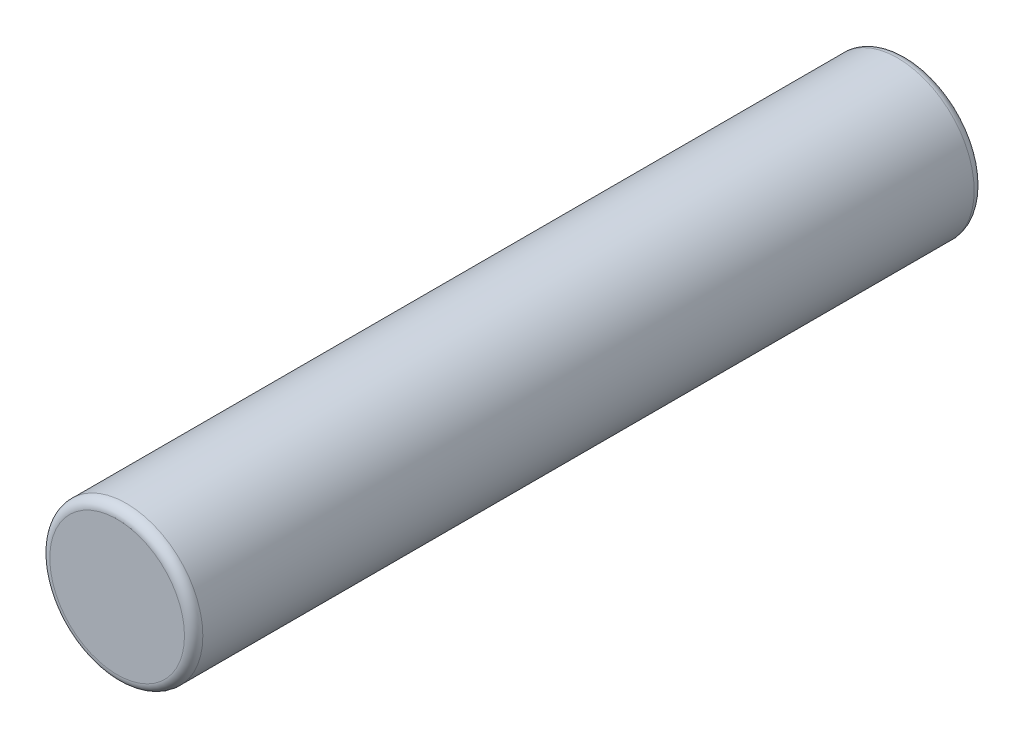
ISO-10303-21;
HEADER;
FILE_DESCRIPTION(('STEP AP214'),'2;1');
FILE_NAME('part.step','',(''),(''),'','','');
FILE_SCHEMA(('AUTOMOTIVE_DESIGN { 1 0 10303 214 1 1 1 1 }'));
ENDSEC;
DATA;
#1=APPLICATION_CONTEXT('core data for automotive mechanical design processes');
#2=APPLICATION_PROTOCOL_DEFINITION('international standard','automotive_design',2000,#1);
#3=PRODUCT_CONTEXT('',#1,'mechanical');
#4=PRODUCT('Part','Part','',(#3));
#5=PRODUCT_RELATED_PRODUCT_CATEGORY('part','',(#4));
#6=PRODUCT_DEFINITION_FORMATION('','',#4);
#7=PRODUCT_DEFINITION_CONTEXT('part definition',#1,'design');
#8=PRODUCT_DEFINITION('design','',#6,#7);
#9=PRODUCT_DEFINITION_SHAPE('','',#8);
#10=(LENGTH_UNIT() NAMED_UNIT(*) SI_UNIT(.MILLI.,.METRE.));
#11=(NAMED_UNIT(*) PLANE_ANGLE_UNIT() SI_UNIT($,.RADIAN.));
#12=(NAMED_UNIT(*) SI_UNIT($,.STERADIAN.) SOLID_ANGLE_UNIT());
#13=UNCERTAINTY_MEASURE_WITH_UNIT(LENGTH_MEASURE(1.E-05),#10,'distance_accuracy_value','');
#14=(GEOMETRIC_REPRESENTATION_CONTEXT(3) GLOBAL_UNCERTAINTY_ASSIGNED_CONTEXT((#13)) GLOBAL_UNIT_ASSIGNED_CONTEXT((#10,
#11,#12)) REPRESENTATION_CONTEXT('',''));
#15=CARTESIAN_POINT('',(0.,0.,0.));
#16=DIRECTION('',(0.,0.,1.));
#17=DIRECTION('',(1.,0.,0.));
#18=AXIS2_PLACEMENT_3D('',#15,#16,#17);
#19=CARTESIAN_POINT('',(0.,0.,25.7999999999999));
#20=DIRECTION('',(0.,0.,-1.));
#21=DIRECTION('',(-1.,0.,0.));
#22=AXIS2_PLACEMENT_3D('',#19,#20,#21);
#23=CYLINDRICAL_SURFACE('',#22,2.5);
#24=CARTESIAN_POINT('',(0.,0.,0.299999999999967));
#25=DIRECTION('',(0.,0.,1.));
#26=DIRECTION('',(1.,0.,0.));
#27=AXIS2_PLACEMENT_3D('',#24,#25,#26);
#28=CIRCLE('',#27,2.5);
#29=CARTESIAN_POINT('',(-2.49999999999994,0.,0.299999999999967));
#30=VERTEX_POINT('',#29);
#31=EDGE_CURVE('E40',#30,#30,#28,.T.);
#32=CARTESIAN_POINT('',(1.11022302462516E-13,0.,25.5));
#33=DIRECTION('',(0.,0.,1.));
#34=DIRECTION('',(1.,0.,0.));
#35=AXIS2_PLACEMENT_3D('',#32,#33,#34);
#36=CIRCLE('',#35,2.5);
#37=CARTESIAN_POINT('',(-2.49999999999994,0.,25.5));
#38=VERTEX_POINT('',#37);
#39=EDGE_CURVE('E44',#38,#38,#36,.F.);
#40=CARTESIAN_POINT('',(-2.49999999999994,0.,0.299999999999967));
#41=CARTESIAN_POINT('',(-2.49999999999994,0.,0.562499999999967));
#42=CARTESIAN_POINT('',(-2.49999999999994,0.,0.824999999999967));
#43=CARTESIAN_POINT('',(-2.49999999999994,0.,1.34999999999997));
#44=CARTESIAN_POINT('',(-2.49999999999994,0.,1.61249999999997));
#45=CARTESIAN_POINT('',(-2.49999999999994,0.,2.13749999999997));
#46=CARTESIAN_POINT('',(-2.49999999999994,0.,2.39999999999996));
#47=CARTESIAN_POINT('',(-2.49999999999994,0.,2.92499999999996));
#48=CARTESIAN_POINT('',(-2.49999999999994,0.,3.18749999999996));
#49=CARTESIAN_POINT('',(-2.49999999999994,0.,3.71249999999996));
#50=CARTESIAN_POINT('',(-2.49999999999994,0.,3.97499999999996));
#51=CARTESIAN_POINT('',(-2.49999999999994,0.,4.49999999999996));
#52=CARTESIAN_POINT('',(-2.49999999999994,0.,4.76249999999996));
#53=CARTESIAN_POINT('',(-2.49999999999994,0.,5.28749999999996));
#54=CARTESIAN_POINT('',(-2.49999999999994,0.,5.54999999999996));
#55=CARTESIAN_POINT('',(-2.49999999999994,0.,6.07499999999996));
#56=CARTESIAN_POINT('',(-2.49999999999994,0.,6.33749999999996));
#57=CARTESIAN_POINT('',(-2.49999999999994,0.,6.86249999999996));
#58=CARTESIAN_POINT('',(-2.49999999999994,0.,7.12499999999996));
#59=CARTESIAN_POINT('',(-2.49999999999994,0.,7.64999999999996));
#60=CARTESIAN_POINT('',(-2.49999999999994,0.,7.91249999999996));
#61=CARTESIAN_POINT('',(-2.49999999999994,0.,8.43749999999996));
#62=CARTESIAN_POINT('',(-2.49999999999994,0.,8.69999999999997));
#63=CARTESIAN_POINT('',(-2.49999999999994,0.,9.22499999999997));
#64=CARTESIAN_POINT('',(-2.49999999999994,0.,9.48749999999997));
#65=CARTESIAN_POINT('',(-2.49999999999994,0.,10.0125));
#66=CARTESIAN_POINT('',(-2.49999999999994,0.,10.275));
#67=CARTESIAN_POINT('',(-2.49999999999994,0.,10.8));
#68=CARTESIAN_POINT('',(-2.49999999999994,0.,11.0625));
#69=CARTESIAN_POINT('',(-2.49999999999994,0.,11.5875));
#70=CARTESIAN_POINT('',(-2.49999999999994,0.,11.85));
#71=CARTESIAN_POINT('',(-2.49999999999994,0.,12.375));
#72=CARTESIAN_POINT('',(-2.49999999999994,0.,12.6375));
#73=CARTESIAN_POINT('',(-2.49999999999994,0.,13.1625));
#74=CARTESIAN_POINT('',(-2.49999999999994,0.,13.425));
#75=CARTESIAN_POINT('',(-2.49999999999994,0.,13.95));
#76=CARTESIAN_POINT('',(-2.49999999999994,0.,14.2125));
#77=CARTESIAN_POINT('',(-2.49999999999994,0.,14.7375));
#78=CARTESIAN_POINT('',(-2.49999999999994,0.,15.));
#79=CARTESIAN_POINT('',(-2.49999999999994,0.,15.525));
#80=CARTESIAN_POINT('',(-2.49999999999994,0.,15.7875));
#81=CARTESIAN_POINT('',(-2.49999999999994,0.,16.3125));
#82=CARTESIAN_POINT('',(-2.49999999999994,0.,16.575));
#83=CARTESIAN_POINT('',(-2.49999999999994,0.,17.1));
#84=CARTESIAN_POINT('',(-2.49999999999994,0.,17.3625));
#85=CARTESIAN_POINT('',(-2.49999999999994,0.,17.8875));
#86=CARTESIAN_POINT('',(-2.49999999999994,0.,18.15));
#87=CARTESIAN_POINT('',(-2.49999999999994,0.,18.675));
#88=CARTESIAN_POINT('',(-2.49999999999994,0.,18.9375));
#89=CARTESIAN_POINT('',(-2.49999999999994,0.,19.4625));
#90=CARTESIAN_POINT('',(-2.49999999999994,0.,19.725));
#91=CARTESIAN_POINT('',(-2.49999999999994,0.,20.25));
#92=CARTESIAN_POINT('',(-2.49999999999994,0.,20.5125));
#93=CARTESIAN_POINT('',(-2.49999999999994,0.,21.0375));
#94=CARTESIAN_POINT('',(-2.49999999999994,0.,21.3));
#95=CARTESIAN_POINT('',(-2.49999999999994,0.,21.825));
#96=CARTESIAN_POINT('',(-2.49999999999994,0.,22.0875));
#97=CARTESIAN_POINT('',(-2.49999999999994,0.,22.6125));
#98=CARTESIAN_POINT('',(-2.49999999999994,0.,22.875));
#99=CARTESIAN_POINT('',(-2.49999999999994,0.,23.4));
#100=CARTESIAN_POINT('',(-2.49999999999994,0.,23.6625));
#101=CARTESIAN_POINT('',(-2.49999999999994,0.,24.1875));
#102=CARTESIAN_POINT('',(-2.49999999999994,0.,24.45));
#103=CARTESIAN_POINT('',(-2.49999999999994,0.,24.975));
#104=CARTESIAN_POINT('',(-2.49999999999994,0.,25.2375));
#105=CARTESIAN_POINT('',(-2.49999999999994,0.,25.5));
#106=B_SPLINE_CURVE_WITH_KNOTS('',3,(#40,#41,#42,#43,#44,#45,#46,#47,#48,#49,#50,#51,#52,#53,
#54,#55,#56,#57,#58,#59,#60,#61,#62,#63,#64,#65,#66,#67,#68,#69,#70,#71,#72,#73,#74,#75,#76,#77,
#78,#79,#80,#81,#82,#83,#84,#85,#86,#87,#88,#89,#90,#91,#92,#93,#94,#95,#96,#97,#98,#99,#100,
#101,#102,#103,#104,#105),.UNSPECIFIED.,.F.,.F.,(4,2,2,2,2,2,2,2,2,2,2,2,2,2,2,2,2,2,2,2,2,2,2,
2,2,2,2,2,2,2,2,2,4),(0.,0.7875,1.575,2.3625,3.15,3.9375,4.725,5.5125,6.3,7.0875,7.875,8.6625,
9.45,10.2375,11.025,11.8125,12.6,13.3875,14.175,14.9625,15.75,16.5375,17.325,18.1125,18.9,
19.6875,20.475,21.2625,22.05,22.8375,23.625,24.4125,25.2),.UNSPECIFIED.);
#107=EDGE_CURVE('BSEAM30',#30,#38,#106,.T.);
#108=ORIENTED_EDGE('',*,*,#31,.T.);
#109=ORIENTED_EDGE('',*,*,#39,.T.);
#110=ORIENTED_EDGE('',*,*,#107,.T.);
#111=ORIENTED_EDGE('',*,*,#107,.F.);
#112=EDGE_LOOP('',(#108,#110,#109,#111));
#113=FACE_BOUND('',#112,.T.);
#114=ADVANCED_FACE('F30',(#113),#23,.T.);
#115=CARTESIAN_POINT('',(0.,0.,25.7999999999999));
#116=DIRECTION('',(0.,0.,1.));
#117=DIRECTION('',(1.,0.,0.));
#118=AXIS2_PLACEMENT_3D('',#115,#116,#117);
#119=PLANE('',#118);
#120=CARTESIAN_POINT('',(0.,0.,25.7999999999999));
#121=DIRECTION('',(0.,0.,1.));
#122=DIRECTION('',(1.,0.,0.));
#123=AXIS2_PLACEMENT_3D('',#120,#121,#122);
#124=CIRCLE('',#123,2.2);
#125=CARTESIAN_POINT('',(2.20000000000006,0.,25.7999999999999));
#126=VERTEX_POINT('',#125);
#127=EDGE_CURVE('E10',#126,#126,#124,.T.);
#128=ORIENTED_EDGE('',*,*,#127,.T.);
#129=EDGE_LOOP('',(#128));
#130=FACE_BOUND('',#129,.T.);
#131=ADVANCED_FACE('F63',(#130),#119,.T.);
#132=CARTESIAN_POINT('',(0.,0.,0.));
#133=DIRECTION('',(0.,0.,1.));
#134=DIRECTION('',(1.,0.,0.));
#135=AXIS2_PLACEMENT_3D('',#132,#133,#134);
#136=PLANE('',#135);
#137=CARTESIAN_POINT('',(0.,0.,0.));
#138=DIRECTION('',(0.,0.,1.));
#139=DIRECTION('',(1.,0.,0.));
#140=AXIS2_PLACEMENT_3D('',#137,#138,#139);
#141=CIRCLE('',#140,2.2);
#142=CARTESIAN_POINT('',(2.2,0.,0.));
#143=VERTEX_POINT('',#142);
#144=EDGE_CURVE('E36',#143,#143,#141,.F.);
#145=ORIENTED_EDGE('',*,*,#144,.T.);
#146=EDGE_LOOP('',(#145));
#147=FACE_BOUND('',#146,.T.);
#148=ADVANCED_FACE('F59',(#147),#136,.F.);
#149=CARTESIAN_POINT('',(0.,0.,0.299999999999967));
#150=DIRECTION('',(0.,0.,1.));
#151=DIRECTION('',(1.,0.,0.));
#152=AXIS2_PLACEMENT_3D('',#149,#150,#151);
#153=TOROIDAL_SURFACE('',#152,2.2,0.3);
#154=ORIENTED_EDGE('',*,*,#144,.F.);
#155=EDGE_LOOP('',(#154));
#156=FACE_BOUND('',#155,.T.);
#157=ORIENTED_EDGE('',*,*,#31,.F.);
#158=EDGE_LOOP('',(#157));
#159=FACE_BOUND('',#158,.T.);
#160=ADVANCED_FACE('F54',(#156,#159),#153,.T.);
#161=CARTESIAN_POINT('',(1.11022302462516E-13,0.,25.5));
#162=DIRECTION('',(0.,0.,1.));
#163=DIRECTION('',(1.,0.,0.));
#164=AXIS2_PLACEMENT_3D('',#161,#162,#163);
#165=TOROIDAL_SURFACE('',#164,2.2,0.3);
#166=ORIENTED_EDGE('',*,*,#39,.F.);
#167=EDGE_LOOP('',(#166));
#168=FACE_BOUND('',#167,.T.);
#169=ORIENTED_EDGE('',*,*,#127,.F.);
#170=EDGE_LOOP('',(#169));
#171=FACE_BOUND('',#170,.T.);
#172=ADVANCED_FACE('F51',(#168,#171),#165,.T.);
#173=CLOSED_SHELL('',(#114,#131,#148,#160,#172));
#174=MANIFOLD_SOLID_BREP('B2',#173);
#175=ADVANCED_BREP_SHAPE_REPRESENTATION('',(#18,#174),#14);
#176=SHAPE_DEFINITION_REPRESENTATION(#9,#175);
ENDSEC;
END-ISO-10303-21;
